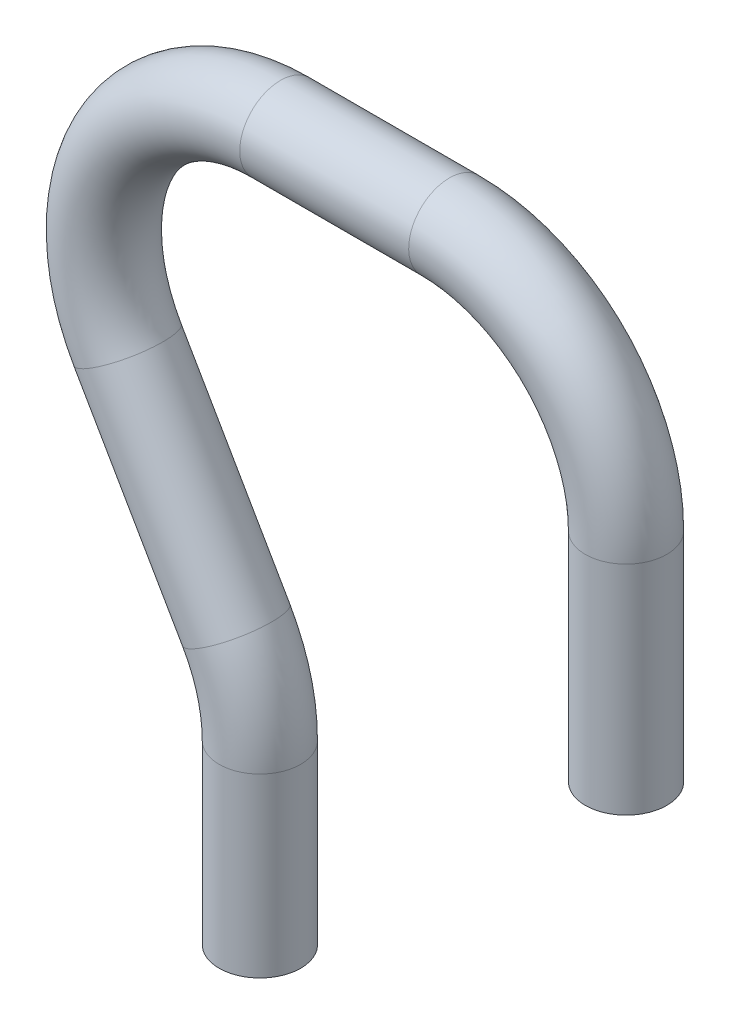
ISO-10303-21;
HEADER;
FILE_DESCRIPTION(('STEP AP214'),'2;1');
FILE_NAME('part.step','',(''),(''),'','','');
FILE_SCHEMA(('AUTOMOTIVE_DESIGN { 1 0 10303 214 1 1 1 1 }'));
ENDSEC;
DATA;
#1=APPLICATION_CONTEXT('core data for automotive mechanical design processes');
#2=APPLICATION_PROTOCOL_DEFINITION('international standard','automotive_design',2000,#1);
#3=PRODUCT_CONTEXT('',#1,'mechanical');
#4=PRODUCT('Part','Part','',(#3));
#5=PRODUCT_RELATED_PRODUCT_CATEGORY('part','',(#4));
#6=PRODUCT_DEFINITION_FORMATION('','',#4);
#7=PRODUCT_DEFINITION_CONTEXT('part definition',#1,'design');
#8=PRODUCT_DEFINITION('design','',#6,#7);
#9=PRODUCT_DEFINITION_SHAPE('','',#8);
#10=(LENGTH_UNIT() NAMED_UNIT(*) SI_UNIT(.MILLI.,.METRE.));
#11=(NAMED_UNIT(*) PLANE_ANGLE_UNIT() SI_UNIT($,.RADIAN.));
#12=(NAMED_UNIT(*) SI_UNIT($,.STERADIAN.) SOLID_ANGLE_UNIT());
#13=UNCERTAINTY_MEASURE_WITH_UNIT(LENGTH_MEASURE(1.E-05),#10,'distance_accuracy_value','');
#14=(GEOMETRIC_REPRESENTATION_CONTEXT(3) GLOBAL_UNCERTAINTY_ASSIGNED_CONTEXT((#13)) GLOBAL_UNIT_ASSIGNED_CONTEXT((#10,
#11,#12)) REPRESENTATION_CONTEXT('',''));
#15=CARTESIAN_POINT('',(0.,0.,0.));
#16=DIRECTION('',(0.,0.,1.));
#17=DIRECTION('',(1.,0.,0.));
#18=AXIS2_PLACEMENT_3D('',#15,#16,#17);
#19=CARTESIAN_POINT('',(42.7837007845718,63.2720452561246,0.));
#20=DIRECTION('',(0.,-1.,0.));
#21=DIRECTION('',(0.,0.,-1.));
#22=AXIS2_PLACEMENT_3D('',#19,#20,#21);
#23=CYLINDRICAL_SURFACE('',#22,4.7625);
#24=CARTESIAN_POINT('',(42.7837007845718,63.2720452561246,0.));
#25=DIRECTION('',(0.,-1.,0.));
#26=DIRECTION('',(0.,0.,1.));
#27=AXIS2_PLACEMENT_3D('',#24,#25,#26);
#28=CIRCLE('',#27,4.7625);
#29=CARTESIAN_POINT('',(47.5462007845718,63.2720452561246,0.));
#30=VERTEX_POINT('',#29);
#31=EDGE_CURVE('E41',#30,#30,#28,.T.);
#32=ORIENTED_EDGE('',*,*,#31,.T.);
#33=EDGE_LOOP('',(#32));
#34=FACE_BOUND('',#33,.T.);
#35=CARTESIAN_POINT('',(42.7837007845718,37.8720452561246,0.));
#36=DIRECTION('',(0.,-1.,0.));
#37=DIRECTION('',(0.,0.,1.));
#38=AXIS2_PLACEMENT_3D('',#35,#36,#37);
#39=CIRCLE('',#38,4.7625);
#40=CARTESIAN_POINT('',(42.7837007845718,37.8720452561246,4.7625));
#41=VERTEX_POINT('',#40);
#42=EDGE_CURVE('E10',#41,#41,#39,.T.);
#43=ORIENTED_EDGE('',*,*,#42,.F.);
#44=EDGE_LOOP('',(#43));
#45=FACE_BOUND('',#44,.T.);
#46=ADVANCED_FACE('F31',(#34,#45),#23,.T.);
#47=CARTESIAN_POINT('',(42.7837007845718,63.2720452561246,0.));
#48=DIRECTION('',(0.,-1.,0.));
#49=DIRECTION('',(0.,0.,-1.));
#50=AXIS2_PLACEMENT_3D('',#47,#48,#49);
#51=CYLINDRICAL_SURFACE('',#50,3.8735);
#52=CARTESIAN_POINT('',(42.7837007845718,63.2720452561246,0.));
#53=DIRECTION('',(0.,-1.,0.));
#54=DIRECTION('',(0.,0.,1.));
#55=AXIS2_PLACEMENT_3D('',#52,#53,#54);
#56=CIRCLE('',#55,3.8735);
#57=CARTESIAN_POINT('',(46.6572007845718,63.2720452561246,0.));
#58=VERTEX_POINT('',#57);
#59=EDGE_CURVE('E45',#58,#58,#56,.T.);
#60=ORIENTED_EDGE('',*,*,#59,.F.);
#61=EDGE_LOOP('',(#60));
#62=FACE_BOUND('',#61,.T.);
#63=CARTESIAN_POINT('',(42.7837007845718,37.8720452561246,0.));
#64=DIRECTION('',(0.,-1.,0.));
#65=DIRECTION('',(0.,0.,1.));
#66=AXIS2_PLACEMENT_3D('',#63,#64,#65);
#67=CIRCLE('',#66,3.8735);
#68=CARTESIAN_POINT('',(42.7837007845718,37.8720452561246,3.8735));
#69=VERTEX_POINT('',#68);
#70=EDGE_CURVE('E37',#69,#69,#67,.T.);
#71=ORIENTED_EDGE('',*,*,#70,.T.);
#72=EDGE_LOOP('',(#71));
#73=FACE_BOUND('',#72,.T.);
#74=ADVANCED_FACE('F125',(#62,#73),#51,.F.);
#75=CARTESIAN_POINT('',(22.1462007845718,63.2720452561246,0.));
#76=DIRECTION('',(0.,0.,-1.));
#77=DIRECTION('',(-1.,0.,0.));
#78=AXIS2_PLACEMENT_3D('',#75,#76,#77);
#79=TOROIDAL_SURFACE('',#78,20.6375,4.7625);
#80=CARTESIAN_POINT('',(22.1462007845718,83.9095452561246,0.));
#81=DIRECTION('',(1.,0.,0.));
#82=DIRECTION('',(0.,0.,1.));
#83=AXIS2_PLACEMENT_3D('',#80,#81,#82);
#84=CIRCLE('',#83,4.7625);
#85=CARTESIAN_POINT('',(22.1462007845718,88.6720452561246,0.));
#86=VERTEX_POINT('',#85);
#87=EDGE_CURVE('E50',#86,#86,#84,.T.);
#88=CARTESIAN_POINT('',(22.1462007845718,63.2720452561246,0.));
#89=DIRECTION('',(0.,0.,-1.));
#90=DIRECTION('',(-1.,0.,0.));
#91=AXIS2_PLACEMENT_3D('',#88,#89,#90);
#92=CIRCLE('',#91,25.4);
#93=EDGE_CURVE('',#86,#30,#92,.T.);
#94=ORIENTED_EDGE('',*,*,#87,.T.);
#95=ORIENTED_EDGE('',*,*,#31,.F.);
#96=ORIENTED_EDGE('',*,*,#93,.T.);
#97=ORIENTED_EDGE('',*,*,#93,.F.);
#98=EDGE_LOOP('',(#94,#96,#95,#97));
#99=FACE_BOUND('',#98,.T.);
#100=ADVANCED_FACE('F121',(#99),#79,.T.);
#101=CARTESIAN_POINT('',(22.1462007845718,63.2720452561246,0.));
#102=DIRECTION('',(0.,0.,-1.));
#103=DIRECTION('',(-1.,0.,0.));
#104=AXIS2_PLACEMENT_3D('',#101,#102,#103);
#105=TOROIDAL_SURFACE('',#104,20.6375,3.8735);
#106=CARTESIAN_POINT('',(22.1462007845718,83.9095452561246,0.));
#107=DIRECTION('',(1.,0.,0.));
#108=DIRECTION('',(0.,0.,1.));
#109=AXIS2_PLACEMENT_3D('',#106,#107,#108);
#110=CIRCLE('',#109,3.8735);
#111=CARTESIAN_POINT('',(22.1462007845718,87.7830452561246,0.));
#112=VERTEX_POINT('',#111);
#113=EDGE_CURVE('E53',#112,#112,#110,.T.);
#114=CARTESIAN_POINT('',(22.1462007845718,63.2720452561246,0.));
#115=DIRECTION('',(0.,0.,-1.));
#116=DIRECTION('',(-1.,0.,0.));
#117=AXIS2_PLACEMENT_3D('',#114,#115,#116);
#118=CIRCLE('',#117,24.511);
#119=EDGE_CURVE('',#112,#58,#118,.T.);
#120=ORIENTED_EDGE('',*,*,#113,.F.);
#121=ORIENTED_EDGE('',*,*,#59,.T.);
#122=ORIENTED_EDGE('',*,*,#119,.T.);
#123=ORIENTED_EDGE('',*,*,#119,.F.);
#124=EDGE_LOOP('',(#120,#122,#121,#123));
#125=FACE_BOUND('',#124,.T.);
#126=ADVANCED_FACE('F118',(#125),#105,.F.);
#127=CARTESIAN_POINT('',(2.40769854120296,83.9095452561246,0.));
#128=DIRECTION('',(1.,0.,0.));
#129=DIRECTION('',(0.,0.,-1.));
#130=AXIS2_PLACEMENT_3D('',#127,#128,#129);
#131=CYLINDRICAL_SURFACE('',#130,4.7625);
#132=CARTESIAN_POINT('',(2.40769854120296,83.9095452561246,0.));
#133=DIRECTION('',(1.,0.,0.));
#134=DIRECTION('',(0.,0.,1.));
#135=AXIS2_PLACEMENT_3D('',#132,#133,#134);
#136=CIRCLE('',#135,4.7625);
#137=CARTESIAN_POINT('',(2.40769854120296,88.6720452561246,0.));
#138=VERTEX_POINT('',#137);
#139=EDGE_CURVE('E56',#138,#138,#136,.T.);
#140=ORIENTED_EDGE('',*,*,#139,.T.);
#141=EDGE_LOOP('',(#140));
#142=FACE_BOUND('',#141,.T.);
#143=ORIENTED_EDGE('',*,*,#87,.F.);
#144=EDGE_LOOP('',(#143));
#145=FACE_BOUND('',#144,.T.);
#146=ADVANCED_FACE('F114',(#142,#145),#131,.T.);
#147=CARTESIAN_POINT('',(2.40769854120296,83.9095452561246,0.));
#148=DIRECTION('',(1.,0.,0.));
#149=DIRECTION('',(0.,0.,-1.));
#150=AXIS2_PLACEMENT_3D('',#147,#148,#149);
#151=CYLINDRICAL_SURFACE('',#150,3.8735);
#152=CARTESIAN_POINT('',(2.40769854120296,83.9095452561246,0.));
#153=DIRECTION('',(1.,0.,0.));
#154=DIRECTION('',(0.,0.,1.));
#155=AXIS2_PLACEMENT_3D('',#152,#153,#154);
#156=CIRCLE('',#155,3.8735);
#157=CARTESIAN_POINT('',(2.40769854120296,87.7830452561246,0.));
#158=VERTEX_POINT('',#157);
#159=EDGE_CURVE('E59',#158,#158,#156,.T.);
#160=ORIENTED_EDGE('',*,*,#159,.F.);
#161=EDGE_LOOP('',(#160));
#162=FACE_BOUND('',#161,.T.);
#163=ORIENTED_EDGE('',*,*,#113,.T.);
#164=EDGE_LOOP('',(#163));
#165=FACE_BOUND('',#164,.T.);
#166=ADVANCED_FACE('F111',(#162,#165),#151,.F.);
#167=CARTESIAN_POINT('',(2.40769854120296,63.2720452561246,0.));
#168=DIRECTION('',(0.,0.,-1.));
#169=DIRECTION('',(-1.,0.,0.));
#170=AXIS2_PLACEMENT_3D('',#167,#168,#169);
#171=TOROIDAL_SURFACE('',#170,20.6375,4.7625);
#172=CARTESIAN_POINT('',(-15.4649007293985,52.9532952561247,0.));
#173=DIRECTION('',(-0.499999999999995,0.866025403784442,0.));
#174=DIRECTION('',(0.,0.,1.));
#175=AXIS2_PLACEMENT_3D('',#172,#173,#174);
#176=CIRCLE('',#175,4.7625);
#177=CARTESIAN_POINT('',(-19.5893467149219,50.5720452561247,0.));
#178=VERTEX_POINT('',#177);
#179=EDGE_CURVE('E62',#178,#178,#176,.T.);
#180=CARTESIAN_POINT('',(2.40769854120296,63.2720452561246,0.));
#181=DIRECTION('',(0.,0.,-1.));
#182=DIRECTION('',(-1.,0.,0.));
#183=AXIS2_PLACEMENT_3D('',#180,#181,#182);
#184=CIRCLE('',#183,25.4);
#185=EDGE_CURVE('',#178,#138,#184,.T.);
#186=ORIENTED_EDGE('',*,*,#179,.T.);
#187=ORIENTED_EDGE('',*,*,#139,.F.);
#188=ORIENTED_EDGE('',*,*,#185,.T.);
#189=ORIENTED_EDGE('',*,*,#185,.F.);
#190=EDGE_LOOP('',(#186,#188,#187,#189));
#191=FACE_BOUND('',#190,.T.);
#192=ADVANCED_FACE('F107',(#191),#171,.T.);
#193=CARTESIAN_POINT('',(2.40769854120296,63.2720452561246,0.));
#194=DIRECTION('',(0.,0.,-1.));
#195=DIRECTION('',(-1.,0.,0.));
#196=AXIS2_PLACEMENT_3D('',#193,#194,#195);
#197=TOROIDAL_SURFACE('',#196,20.6375,3.8735);
#198=CARTESIAN_POINT('',(-15.4649007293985,52.9532952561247,0.));
#199=DIRECTION('',(-0.499999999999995,0.866025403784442,0.));
#200=DIRECTION('',(0.,0.,1.));
#201=AXIS2_PLACEMENT_3D('',#198,#199,#200);
#202=CIRCLE('',#201,3.8735);
#203=CARTESIAN_POINT('',(-18.8194501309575,51.0165452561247,0.));
#204=VERTEX_POINT('',#203);
#205=EDGE_CURVE('E65',#204,#204,#202,.T.);
#206=CARTESIAN_POINT('',(2.40769854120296,63.2720452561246,0.));
#207=DIRECTION('',(0.,0.,-1.));
#208=DIRECTION('',(-1.,0.,0.));
#209=AXIS2_PLACEMENT_3D('',#206,#207,#208);
#210=CIRCLE('',#209,24.511);
#211=EDGE_CURVE('',#204,#158,#210,.T.);
#212=ORIENTED_EDGE('',*,*,#205,.F.);
#213=ORIENTED_EDGE('',*,*,#159,.T.);
#214=ORIENTED_EDGE('',*,*,#211,.T.);
#215=ORIENTED_EDGE('',*,*,#211,.F.);
#216=EDGE_LOOP('',(#212,#214,#213,#215));
#217=FACE_BOUND('',#216,.T.);
#218=ADVANCED_FACE('F104',(#217),#197,.F.);
#219=CARTESIAN_POINT('',(-2.76490072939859,30.9562499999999,0.));
#220=DIRECTION('',(-0.499999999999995,0.866025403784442,0.));
#221=DIRECTION('',(-0.866025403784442,-0.499999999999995,0.));
#222=AXIS2_PLACEMENT_3D('',#219,#220,#221);
#223=CYLINDRICAL_SURFACE('',#222,4.7625);
#224=CARTESIAN_POINT('',(-2.76490072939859,30.9562499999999,0.));
#225=DIRECTION('',(-0.499999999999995,0.866025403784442,0.));
#226=DIRECTION('',(0.,0.,1.));
#227=AXIS2_PLACEMENT_3D('',#224,#225,#226);
#228=CIRCLE('',#227,4.7625);
#229=CARTESIAN_POINT('',(1.35954525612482,33.3374999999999,0.));
#230=VERTEX_POINT('',#229);
#231=EDGE_CURVE('E68',#230,#230,#228,.T.);
#232=ORIENTED_EDGE('',*,*,#231,.T.);
#233=EDGE_LOOP('',(#232));
#234=FACE_BOUND('',#233,.T.);
#235=ORIENTED_EDGE('',*,*,#179,.F.);
#236=EDGE_LOOP('',(#235));
#237=FACE_BOUND('',#236,.T.);
#238=ADVANCED_FACE('F100',(#234,#237),#223,.T.);
#239=CARTESIAN_POINT('',(-2.76490072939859,30.9562499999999,0.));
#240=DIRECTION('',(-0.499999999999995,0.866025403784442,0.));
#241=DIRECTION('',(-0.866025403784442,-0.499999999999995,0.));
#242=AXIS2_PLACEMENT_3D('',#239,#240,#241);
#243=CYLINDRICAL_SURFACE('',#242,3.8735);
#244=CARTESIAN_POINT('',(-2.76490072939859,30.9562499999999,0.));
#245=DIRECTION('',(-0.499999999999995,0.866025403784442,0.));
#246=DIRECTION('',(0.,0.,1.));
#247=AXIS2_PLACEMENT_3D('',#244,#245,#246);
#248=CIRCLE('',#247,3.8735);
#249=CARTESIAN_POINT('',(0.58964867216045,32.8929999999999,0.));
#250=VERTEX_POINT('',#249);
#251=EDGE_CURVE('E71',#250,#250,#248,.T.);
#252=ORIENTED_EDGE('',*,*,#251,.F.);
#253=EDGE_LOOP('',(#252));
#254=FACE_BOUND('',#253,.T.);
#255=ORIENTED_EDGE('',*,*,#205,.T.);
#256=EDGE_LOOP('',(#255));
#257=FACE_BOUND('',#256,.T.);
#258=ADVANCED_FACE('F97',(#254,#257),#243,.F.);
#259=CARTESIAN_POINT('',(-20.6375,20.6375,0.));
#260=DIRECTION('',(0.,0.,1.));
#261=DIRECTION('',(1.,0.,0.));
#262=AXIS2_PLACEMENT_3D('',#259,#260,#261);
#263=TOROIDAL_SURFACE('',#262,20.6375,4.7625);
#264=CARTESIAN_POINT('',(0.,20.6375,0.));
#265=DIRECTION('',(0.,1.,0.));
#266=DIRECTION('',(0.,0.,1.));
#267=AXIS2_PLACEMENT_3D('',#264,#265,#266);
#268=CIRCLE('',#267,4.7625);
#269=CARTESIAN_POINT('',(4.7625,20.6375,0.));
#270=VERTEX_POINT('',#269);
#271=EDGE_CURVE('E74',#270,#270,#268,.T.);
#272=CARTESIAN_POINT('',(-20.6375,20.6375,0.));
#273=DIRECTION('',(0.,0.,1.));
#274=DIRECTION('',(1.,0.,0.));
#275=AXIS2_PLACEMENT_3D('',#272,#273,#274);
#276=CIRCLE('',#275,25.4);
#277=EDGE_CURVE('',#270,#230,#276,.T.);
#278=ORIENTED_EDGE('',*,*,#271,.T.);
#279=ORIENTED_EDGE('',*,*,#231,.F.);
#280=ORIENTED_EDGE('',*,*,#277,.T.);
#281=ORIENTED_EDGE('',*,*,#277,.F.);
#282=EDGE_LOOP('',(#278,#280,#279,#281));
#283=FACE_BOUND('',#282,.T.);
#284=ADVANCED_FACE('F93',(#283),#263,.T.);
#285=CARTESIAN_POINT('',(-20.6375,20.6375,0.));
#286=DIRECTION('',(0.,0.,1.));
#287=DIRECTION('',(1.,0.,0.));
#288=AXIS2_PLACEMENT_3D('',#285,#286,#287);
#289=TOROIDAL_SURFACE('',#288,20.6375,3.8735);
#290=CARTESIAN_POINT('',(0.,20.6375,0.));
#291=DIRECTION('',(0.,1.,0.));
#292=DIRECTION('',(0.,0.,1.));
#293=AXIS2_PLACEMENT_3D('',#290,#291,#292);
#294=CIRCLE('',#293,3.8735);
#295=CARTESIAN_POINT('',(3.8735,20.6375,0.));
#296=VERTEX_POINT('',#295);
#297=EDGE_CURVE('E78',#296,#296,#294,.T.);
#298=CARTESIAN_POINT('',(-20.6375,20.6375,0.));
#299=DIRECTION('',(0.,0.,1.));
#300=DIRECTION('',(1.,0.,0.));
#301=AXIS2_PLACEMENT_3D('',#298,#299,#300);
#302=CIRCLE('',#301,24.511);
#303=EDGE_CURVE('',#296,#250,#302,.T.);
#304=ORIENTED_EDGE('',*,*,#297,.F.);
#305=ORIENTED_EDGE('',*,*,#251,.T.);
#306=ORIENTED_EDGE('',*,*,#303,.T.);
#307=ORIENTED_EDGE('',*,*,#303,.F.);
#308=EDGE_LOOP('',(#304,#306,#305,#307));
#309=FACE_BOUND('',#308,.T.);
#310=ADVANCED_FACE('F90',(#309),#289,.F.);
#311=CARTESIAN_POINT('',(0.,20.6375,0.));
#312=DIRECTION('',(0.,-1.,0.));
#313=DIRECTION('',(0.,0.,-1.));
#314=AXIS2_PLACEMENT_3D('',#311,#312,#313);
#315=CYLINDRICAL_SURFACE('',#314,3.8735);
#316=ORIENTED_EDGE('',*,*,#297,.T.);
#317=EDGE_LOOP('',(#316));
#318=FACE_BOUND('',#317,.T.);
#319=CARTESIAN_POINT('',(0.,0.,0.));
#320=DIRECTION('',(0.,1.,0.));
#321=DIRECTION('',(0.,0.,1.));
#322=AXIS2_PLACEMENT_3D('',#319,#320,#321);
#323=CIRCLE('',#322,3.8735);
#324=CARTESIAN_POINT('',(0.,0.,3.8735));
#325=VERTEX_POINT('',#324);
#326=EDGE_CURVE('E79',#325,#325,#323,.T.);
#327=ORIENTED_EDGE('',*,*,#326,.F.);
#328=EDGE_LOOP('',(#327));
#329=FACE_BOUND('',#328,.T.);
#330=ADVANCED_FACE('F87',(#318,#329),#315,.F.);
#331=CARTESIAN_POINT('',(0.,20.6375,0.));
#332=DIRECTION('',(0.,-1.,0.));
#333=DIRECTION('',(0.,0.,-1.));
#334=AXIS2_PLACEMENT_3D('',#331,#332,#333);
#335=CYLINDRICAL_SURFACE('',#334,4.7625);
#336=ORIENTED_EDGE('',*,*,#271,.F.);
#337=EDGE_LOOP('',(#336));
#338=FACE_BOUND('',#337,.T.);
#339=CARTESIAN_POINT('',(0.,0.,0.));
#340=DIRECTION('',(0.,1.,0.));
#341=DIRECTION('',(0.,0.,1.));
#342=AXIS2_PLACEMENT_3D('',#339,#340,#341);
#343=CIRCLE('',#342,4.7625);
#344=CARTESIAN_POINT('',(0.,0.,4.7625));
#345=VERTEX_POINT('',#344);
#346=EDGE_CURVE('E75',#345,#345,#343,.T.);
#347=ORIENTED_EDGE('',*,*,#346,.T.);
#348=EDGE_LOOP('',(#347));
#349=FACE_BOUND('',#348,.T.);
#350=ADVANCED_FACE('F149',(#338,#349),#335,.T.);
#351=CARTESIAN_POINT('',(42.7837007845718,37.8720452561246,0.));
#352=DIRECTION('',(0.,-1.,0.));
#353=DIRECTION('',(0.,0.,1.));
#354=AXIS2_PLACEMENT_3D('',#351,#352,#353);
#355=PLANE('',#354);
#356=ORIENTED_EDGE('',*,*,#70,.F.);
#357=EDGE_LOOP('',(#356));
#358=FACE_BOUND('',#357,.T.);
#359=ORIENTED_EDGE('',*,*,#42,.T.);
#360=EDGE_LOOP('',(#359));
#361=FACE_BOUND('',#360,.T.);
#362=ADVANCED_FACE('F152',(#358,#361),#355,.T.);
#363=CARTESIAN_POINT('',(0.,0.,0.));
#364=DIRECTION('',(0.,1.,0.));
#365=DIRECTION('',(0.,0.,1.));
#366=AXIS2_PLACEMENT_3D('',#363,#364,#365);
#367=PLANE('',#366);
#368=ORIENTED_EDGE('',*,*,#326,.T.);
#369=EDGE_LOOP('',(#368));
#370=FACE_BOUND('',#369,.T.);
#371=ORIENTED_EDGE('',*,*,#346,.F.);
#372=EDGE_LOOP('',(#371));
#373=FACE_BOUND('',#372,.T.);
#374=ADVANCED_FACE('F154',(#370,#373),#367,.F.);
#375=CLOSED_SHELL('',(#46,#74,#100,#126,#146,#166,#192,#218,#238,#258,#284,#310,#330,#350,#362,#374));
#376=MANIFOLD_SOLID_BREP('B2',#375);
#377=ADVANCED_BREP_SHAPE_REPRESENTATION('',(#18,#376),#14);
#378=SHAPE_DEFINITION_REPRESENTATION(#9,#377);
ENDSEC;
END-ISO-10303-21;
